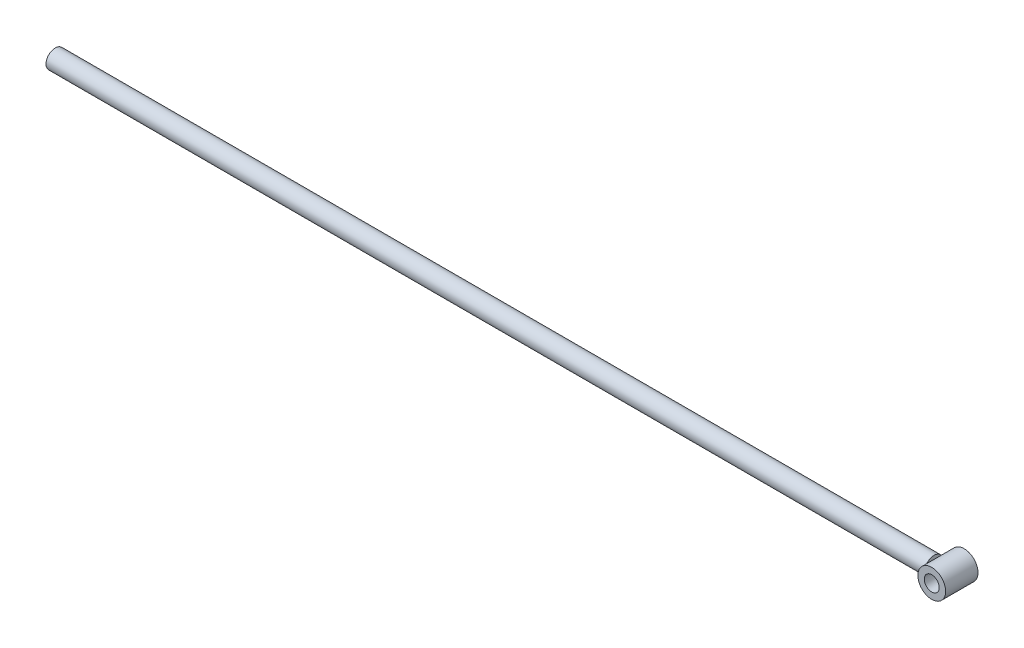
from build123d import *

# Parameters (mm, degrees)
ESQUISSE1_R      = 10
EXTRUSION1_DEPTH = 950
ESQUISSE2_R      = 15
ESQUISSE2_R_2    = 8.1
EXTRUSION2_DEPTH = 17.5


with BuildPart() as part:
    # Esquisse1 → Extrusion1 (new body)
    with BuildSketch(Plane(origin=(0, 0, 0), x_dir=(0, 0, -1), z_dir=(1, 0, 0))):
        with Locations(Location((0, 0, 0), (0, 0, 180))):
            Circle(ESQUISSE1_R)
    extrude(amount=EXTRUSION1_DEPTH)


with BuildPart() as body_2:
    # Esquisse2 → Extrusion2 (new, symmetric)
    with BuildSketch(Plane.XY):
        with Locations((965, 0)):
            Circle(ESQUISSE2_R)
        with Locations((965, 0)):
            Circle(ESQUISSE2_R_2, mode=Mode.SUBTRACT)
    extrude(amount=EXTRUSION2_DEPTH, both=True)


solid = Compound([part.part, body_2.part])
